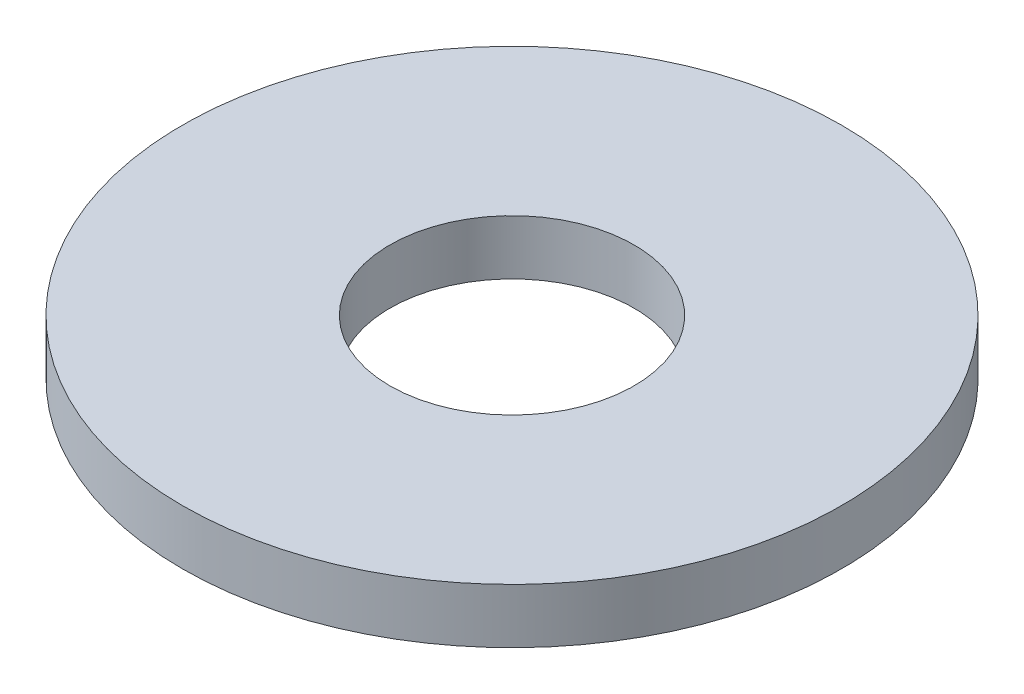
from build123d import *

# Parameters (mm, degrees)
SKETCH1_R           = 5.3467
SKETCH1_R_2         = 1.9812
BOSS_EXTRUDE1_DEPTH = 0.889


with BuildPart() as part:
    # Sketch1 → Boss-Extrude1 (new body)
    with BuildSketch(Plane(origin=(0, 0, 0), x_dir=(1, 0, 0), z_dir=(0, 1, 0))):
        with Locations(Location((0, 0, 0), (0, 0, 270))):
            Circle(SKETCH1_R)
        with Locations(Location((0, 0, 0), (0, 0, 270))):
            Circle(SKETCH1_R_2, mode=Mode.SUBTRACT)
    extrude(amount=BOSS_EXTRUDE1_DEPTH)


solid = part.part
